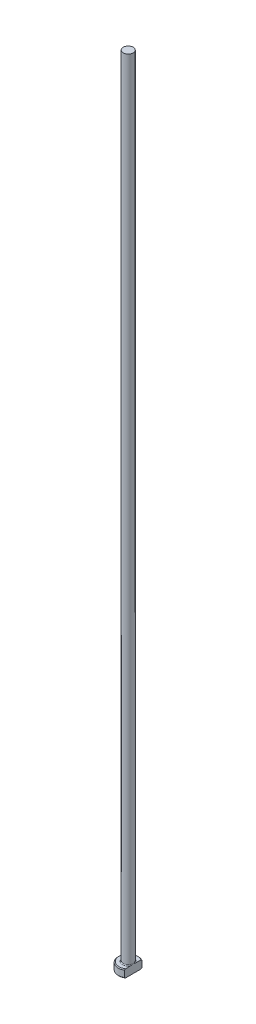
from build123d import *
from build123d.topology import SkipClean

# Parameters (mm, degrees)
CHAMFER1_SIZE = 0.2
FILLET1_R     = 0.2
KEY_DEPTH     = 201.031247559


with BuildPart() as part:
    # Sketch1 → Revolve1 (revolve)
    with BuildSketch(Plane.XY, mode=Mode.PRIVATE) as revolve1_sk:
        Polygon((0, 0), (-2.5, 0), (-2.5, 2), (-1.25, 2), (-1.25, 200), (0, 200), align=None)
    revolve(revolve1_sk.sketch.rotate(Axis((0, 259.958771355, 0), (0, -1, 0)), 270), axis=Axis((0, 259.958771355, 0), (0, -1, 0)))

    # Chamfer1
    chamfer1_edges = [part.edges().sort_by_distance(p)[0] for p in [
        (0, 2, -2.5),
        (0, 0, -2.5),
    ]]
    chamfer(chamfer1_edges, length=CHAMFER1_SIZE)

    # Fillet1
    fillet1_edges = [part.edges().sort_by_distance(p)[0] for p in [
        (0, 2, -1.25),
    ]]
    fillet(fillet1_edges, radius=FILLET1_R)

    # Sketch2 → KEY (cut, through all)
    with SkipClean():  # the faces are left unmerged after this step: merging them gives an invalid solid
        with BuildSketch(Plane(origin=(0, 0, 0), x_dir=(1, 0, 0), z_dir=(0, 1, 0))):
            with BuildLine():
                Line((1.25, 2.165063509), (1.25, -2.165063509))
                ThreePointArc((1.25, -2.165063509), (2.5, 0), (1.25, 2.165063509))
            make_face()
        extrude(amount=KEY_DEPTH, mode=Mode.SUBTRACT)


solid = part.part
